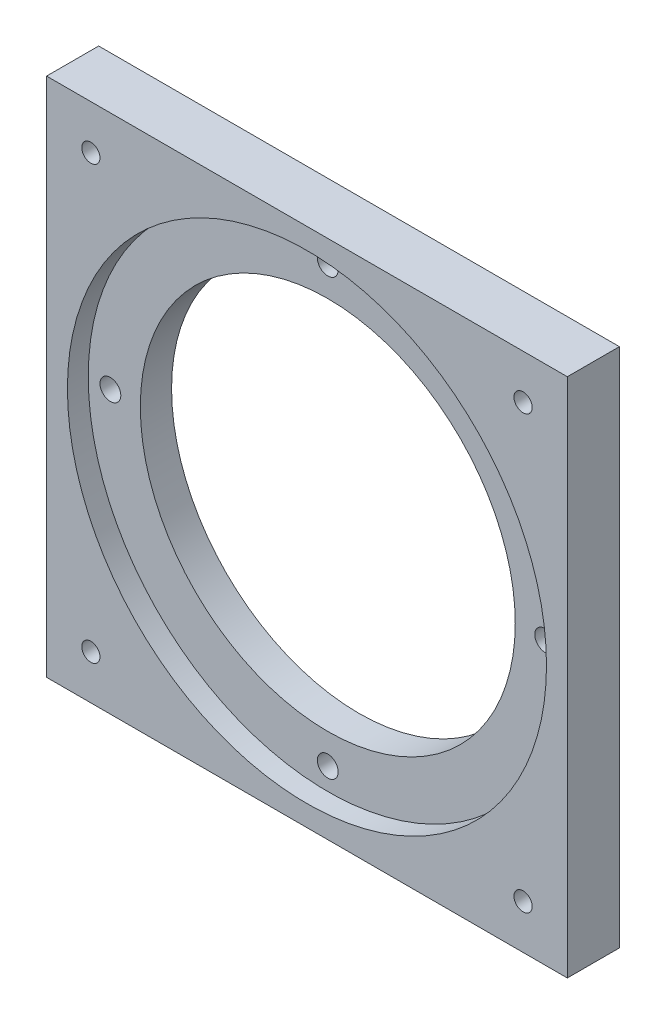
from build123d import *

# Parameters (mm, degrees)
SKETCH_1_W          = 100
SKETCH_1_H          = 100
SKETCH_1_R          = 36
EXTRUDE_1_DEPTH     = 10
SKETCH_2_R          = 46
CUT_EXTRUDE_1_DEPTH = 4
SKETCH_3_R          = 2
CUT_EXTRUDE_2_DEPTH = 142.548578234
SKETCH_4_R          = 1.75
CUT_EXTRUDE_3_DEPTH = 8


with BuildPart() as part:
    # Sketch 1 → Extrude 1 (new body)
    with BuildSketch(Plane.XY):
        with Locations((50, 50)):
            Rectangle(SKETCH_1_W, SKETCH_1_H)
        with Locations((50, 50)):
            Circle(SKETCH_1_R, mode=Mode.SUBTRACT)
    extrude(amount=EXTRUDE_1_DEPTH)

    # Sketch 2 → Cut-Extrude 1 (cut)
    with BuildSketch(Plane.XY.offset(10)):
        with Locations((50, 50)):
            Circle(SKETCH_2_R)
    extrude(amount=-CUT_EXTRUDE_1_DEPTH, mode=Mode.SUBTRACT)

    # Sketch 3 → Cut-Extrude 2 (cut, through all)
    with BuildSketch(Plane.XY.offset(6)):
        with Locations((8.25, 50)):
            Circle(SKETCH_3_R)
        with Locations((50, 91.75)):
            Circle(SKETCH_3_R)
        with Locations((91.75, 50)):
            Circle(SKETCH_3_R)
        with Locations((50, 8.25)):
            Circle(SKETCH_3_R)
    extrude(amount=-CUT_EXTRUDE_2_DEPTH, mode=Mode.SUBTRACT)

    # Sketch 4 → Cut-Extrude 3 (cut)
    with BuildSketch(Plane.XY.offset(10)):
        with Locations((8.5, 91.5)):
            Circle(SKETCH_4_R)
        with Locations((91.5, 91.5)):
            Circle(SKETCH_4_R)
        with Locations((8.5, 8.5)):
            Circle(SKETCH_4_R)
        with Locations((91.5, 8.5)):
            Circle(SKETCH_4_R)
    extrude(amount=-CUT_EXTRUDE_3_DEPTH, mode=Mode.SUBTRACT)


solid = part.part
